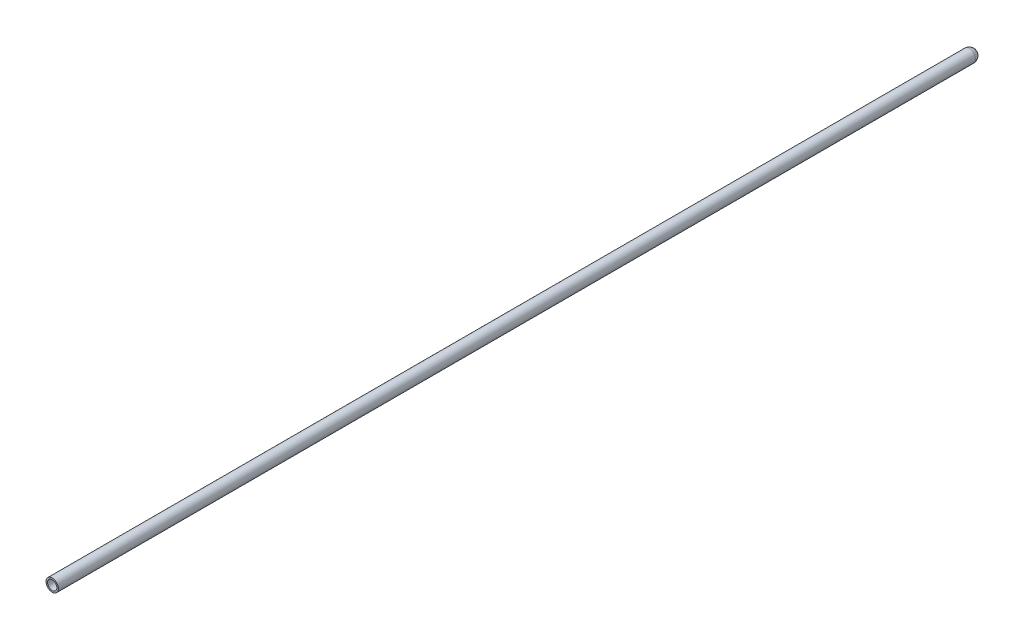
ISO-10303-21;
HEADER;
FILE_DESCRIPTION(('STEP AP214'),'2;1');
FILE_NAME('part.step','',(''),(''),'','','');
FILE_SCHEMA(('AUTOMOTIVE_DESIGN { 1 0 10303 214 1 1 1 1 }'));
ENDSEC;
DATA;
#1=APPLICATION_CONTEXT('core data for automotive mechanical design processes');
#2=APPLICATION_PROTOCOL_DEFINITION('international standard','automotive_design',2000,#1);
#3=PRODUCT_CONTEXT('',#1,'mechanical');
#4=PRODUCT('Part','Part','',(#3));
#5=PRODUCT_RELATED_PRODUCT_CATEGORY('part','',(#4));
#6=PRODUCT_DEFINITION_FORMATION('','',#4);
#7=PRODUCT_DEFINITION_CONTEXT('part definition',#1,'design');
#8=PRODUCT_DEFINITION('design','',#6,#7);
#9=PRODUCT_DEFINITION_SHAPE('','',#8);
#10=(LENGTH_UNIT() NAMED_UNIT(*) SI_UNIT(.MILLI.,.METRE.));
#11=(NAMED_UNIT(*) PLANE_ANGLE_UNIT() SI_UNIT($,.RADIAN.));
#12=(NAMED_UNIT(*) SI_UNIT($,.STERADIAN.) SOLID_ANGLE_UNIT());
#13=UNCERTAINTY_MEASURE_WITH_UNIT(LENGTH_MEASURE(1.E-05),#10,'distance_accuracy_value','');
#14=(GEOMETRIC_REPRESENTATION_CONTEXT(3) GLOBAL_UNCERTAINTY_ASSIGNED_CONTEXT((#13)) GLOBAL_UNIT_ASSIGNED_CONTEXT((#10,
#11,#12)) REPRESENTATION_CONTEXT('',''));
#15=CARTESIAN_POINT('',(0.,0.,0.));
#16=DIRECTION('',(0.,0.,1.));
#17=DIRECTION('',(1.,0.,0.));
#18=AXIS2_PLACEMENT_3D('',#15,#16,#17);
#19=CARTESIAN_POINT('',(0.,0.,0.));
#20=DIRECTION('',(0.,0.,1.));
#21=DIRECTION('',(1.,0.,0.));
#22=AXIS2_PLACEMENT_3D('',#19,#20,#21);
#23=CYLINDRICAL_SURFACE('',#22,2.);
#24=CARTESIAN_POINT('',(0.,0.,0.));
#25=DIRECTION('',(0.,0.,1.));
#26=DIRECTION('',(1.,0.,0.));
#27=AXIS2_PLACEMENT_3D('',#24,#25,#26);
#28=CIRCLE('',#27,2.);
#29=CARTESIAN_POINT('',(2.,0.,0.));
#30=VERTEX_POINT('',#29);
#31=EDGE_CURVE('E44',#30,#30,#28,.T.);
#32=ORIENTED_EDGE('',*,*,#31,.F.);
#33=EDGE_LOOP('',(#32));
#34=FACE_BOUND('',#33,.T.);
#35=CARTESIAN_POINT('',(0.,0.,-295.1692));
#36=DIRECTION('',(0.,0.,1.));
#37=DIRECTION('',(1.,0.,0.));
#38=AXIS2_PLACEMENT_3D('',#35,#36,#37);
#39=CIRCLE('',#38,2.);
#40=CARTESIAN_POINT('',(2.,0.,-295.1692));
#41=VERTEX_POINT('',#40);
#42=EDGE_CURVE('E10',#41,#41,#39,.T.);
#43=ORIENTED_EDGE('',*,*,#42,.T.);
#44=EDGE_LOOP('',(#43));
#45=FACE_BOUND('',#44,.T.);
#46=ADVANCED_FACE('F30',(#34,#45),#23,.T.);
#47=CARTESIAN_POINT('',(0.,0.,-295.1692));
#48=DIRECTION('',(0.,0.,1.));
#49=DIRECTION('',(0.,-1.,0.));
#50=AXIS2_PLACEMENT_3D('',#47,#48,#49);
#51=SPHERICAL_SURFACE('',#50,2.);
#52=ORIENTED_EDGE('',*,*,#42,.F.);
#53=EDGE_LOOP('',(#52));
#54=FACE_BOUND('',#53,.T.);
#55=ADVANCED_FACE('F53',(#54),#51,.T.);
#56=CARTESIAN_POINT('',(0.,0.,-295.1692));
#57=DIRECTION('',(0.,0.,1.));
#58=DIRECTION('',(0.,1.,0.));
#59=AXIS2_PLACEMENT_3D('',#56,#57,#58);
#60=SPHERICAL_SURFACE('',#59,1.5);
#61=CARTESIAN_POINT('',(0.,0.,-295.1692));
#62=DIRECTION('',(0.,0.,1.));
#63=DIRECTION('',(1.,0.,0.));
#64=AXIS2_PLACEMENT_3D('',#61,#62,#63);
#65=CIRCLE('',#64,1.5);
#66=CARTESIAN_POINT('',(1.5,0.,-295.1692));
#67=VERTEX_POINT('',#66);
#68=EDGE_CURVE('E36',#67,#67,#65,.T.);
#69=ORIENTED_EDGE('',*,*,#68,.T.);
#70=EDGE_LOOP('',(#69));
#71=FACE_BOUND('',#70,.T.);
#72=ADVANCED_FACE('F57',(#71),#60,.F.);
#73=CARTESIAN_POINT('',(0.,0.,0.));
#74=DIRECTION('',(0.,0.,1.));
#75=DIRECTION('',(1.,0.,0.));
#76=AXIS2_PLACEMENT_3D('',#73,#74,#75);
#77=CYLINDRICAL_SURFACE('',#76,1.5);
#78=ORIENTED_EDGE('',*,*,#68,.F.);
#79=EDGE_LOOP('',(#78));
#80=FACE_BOUND('',#79,.T.);
#81=CARTESIAN_POINT('',(0.,0.,0.));
#82=DIRECTION('',(0.,0.,1.));
#83=DIRECTION('',(1.,0.,0.));
#84=AXIS2_PLACEMENT_3D('',#81,#82,#83);
#85=CIRCLE('',#84,1.5);
#86=CARTESIAN_POINT('',(1.5,0.,0.));
#87=VERTEX_POINT('',#86);
#88=EDGE_CURVE('E40',#87,#87,#85,.T.);
#89=ORIENTED_EDGE('',*,*,#88,.T.);
#90=EDGE_LOOP('',(#89));
#91=FACE_BOUND('',#90,.T.);
#92=ADVANCED_FACE('F62',(#80,#91),#77,.F.);
#93=CARTESIAN_POINT('',(0.,1.5,0.));
#94=DIRECTION('',(0.,0.,-1.));
#95=DIRECTION('',(-1.,0.,0.));
#96=AXIS2_PLACEMENT_3D('',#93,#94,#95);
#97=PLANE('',#96);
#98=ORIENTED_EDGE('',*,*,#88,.F.);
#99=EDGE_LOOP('',(#98));
#100=FACE_BOUND('',#99,.T.);
#101=ORIENTED_EDGE('',*,*,#31,.T.);
#102=EDGE_LOOP('',(#101));
#103=FACE_BOUND('',#102,.T.);
#104=ADVANCED_FACE('F50',(#100,#103),#97,.F.);
#105=CLOSED_SHELL('',(#46,#55,#72,#92,#104));
#106=MANIFOLD_SOLID_BREP('B2',#105);
#107=ADVANCED_BREP_SHAPE_REPRESENTATION('',(#18,#106),#14);
#108=SHAPE_DEFINITION_REPRESENTATION(#9,#107);
ENDSEC;
END-ISO-10303-21;
